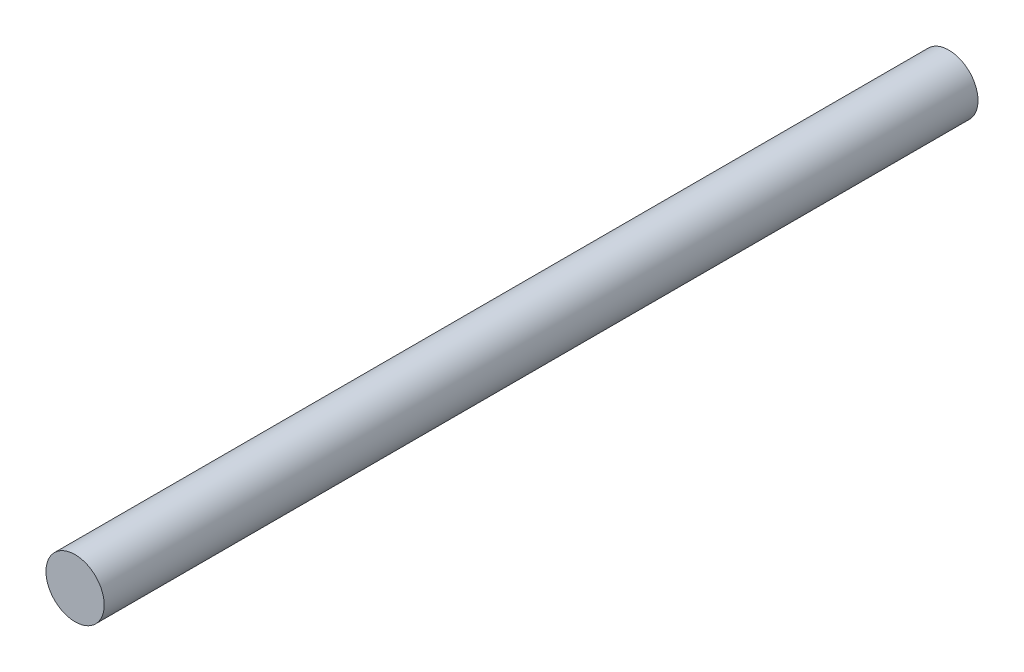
ISO-10303-21;
HEADER;
FILE_DESCRIPTION(('STEP AP214'),'2;1');
FILE_NAME('part.step','',(''),(''),'','','');
FILE_SCHEMA(('AUTOMOTIVE_DESIGN { 1 0 10303 214 1 1 1 1 }'));
ENDSEC;
DATA;
#1=APPLICATION_CONTEXT('core data for automotive mechanical design processes');
#2=APPLICATION_PROTOCOL_DEFINITION('international standard','automotive_design',2000,#1);
#3=PRODUCT_CONTEXT('',#1,'mechanical');
#4=PRODUCT('Part','Part','',(#3));
#5=PRODUCT_RELATED_PRODUCT_CATEGORY('part','',(#4));
#6=PRODUCT_DEFINITION_FORMATION('','',#4);
#7=PRODUCT_DEFINITION_CONTEXT('part definition',#1,'design');
#8=PRODUCT_DEFINITION('design','',#6,#7);
#9=PRODUCT_DEFINITION_SHAPE('','',#8);
#10=(LENGTH_UNIT() NAMED_UNIT(*) SI_UNIT(.MILLI.,.METRE.));
#11=(NAMED_UNIT(*) PLANE_ANGLE_UNIT() SI_UNIT($,.RADIAN.));
#12=(NAMED_UNIT(*) SI_UNIT($,.STERADIAN.) SOLID_ANGLE_UNIT());
#13=UNCERTAINTY_MEASURE_WITH_UNIT(LENGTH_MEASURE(1.E-05),#10,'distance_accuracy_value','');
#14=(GEOMETRIC_REPRESENTATION_CONTEXT(3) GLOBAL_UNCERTAINTY_ASSIGNED_CONTEXT((#13)) GLOBAL_UNIT_ASSIGNED_CONTEXT((#10,
#11,#12)) REPRESENTATION_CONTEXT('',''));
#15=CARTESIAN_POINT('',(0.,0.,0.));
#16=DIRECTION('',(0.,0.,1.));
#17=DIRECTION('',(1.,0.,0.));
#18=AXIS2_PLACEMENT_3D('',#15,#16,#17);
#19=CARTESIAN_POINT('',(0.,0.,-762.));
#20=DIRECTION('',(0.,0.,1.));
#21=DIRECTION('',(1.,0.,0.));
#22=AXIS2_PLACEMENT_3D('',#19,#20,#21);
#23=CYLINDRICAL_SURFACE('',#22,25.4);
#24=CARTESIAN_POINT('',(0.,0.,-762.));
#25=DIRECTION('',(0.,0.,1.));
#26=DIRECTION('',(1.,0.,0.));
#27=AXIS2_PLACEMENT_3D('',#24,#25,#26);
#28=CIRCLE('',#27,25.4);
#29=CARTESIAN_POINT('',(25.4,0.,-762.));
#30=VERTEX_POINT('',#29);
#31=EDGE_CURVE('E10',#30,#30,#28,.T.);
#32=ORIENTED_EDGE('',*,*,#31,.T.);
#33=EDGE_LOOP('',(#32));
#34=FACE_BOUND('',#33,.T.);
#35=CARTESIAN_POINT('',(0.,0.,0.));
#36=DIRECTION('',(0.,0.,1.));
#37=DIRECTION('',(1.,0.,0.));
#38=AXIS2_PLACEMENT_3D('',#35,#36,#37);
#39=CIRCLE('',#38,25.4);
#40=CARTESIAN_POINT('',(25.4,0.,0.));
#41=VERTEX_POINT('',#40);
#42=EDGE_CURVE('E46',#41,#41,#39,.T.);
#43=ORIENTED_EDGE('',*,*,#42,.F.);
#44=EDGE_LOOP('',(#43));
#45=FACE_BOUND('',#44,.T.);
#46=ADVANCED_FACE('F43',(#34,#45),#23,.T.);
#47=CARTESIAN_POINT('',(0.,0.,-762.));
#48=DIRECTION('',(0.,0.,1.));
#49=DIRECTION('',(1.,0.,0.));
#50=AXIS2_PLACEMENT_3D('',#47,#48,#49);
#51=PLANE('',#50);
#52=ORIENTED_EDGE('',*,*,#31,.F.);
#53=EDGE_LOOP('',(#52));
#54=FACE_BOUND('',#53,.T.);
#55=ADVANCED_FACE('F58',(#54),#51,.F.);
#56=CARTESIAN_POINT('',(0.,0.,0.));
#57=DIRECTION('',(0.,0.,1.));
#58=DIRECTION('',(1.,0.,0.));
#59=AXIS2_PLACEMENT_3D('',#56,#57,#58);
#60=PLANE('',#59);
#61=ORIENTED_EDGE('',*,*,#42,.T.);
#62=EDGE_LOOP('',(#61));
#63=FACE_BOUND('',#62,.T.);
#64=ADVANCED_FACE('F60',(#63),#60,.T.);
#65=CLOSED_SHELL('',(#46,#55,#64));
#66=MANIFOLD_SOLID_BREP('B2',#65);
#67=ADVANCED_BREP_SHAPE_REPRESENTATION('',(#18,#66),#14);
#68=SHAPE_DEFINITION_REPRESENTATION(#9,#67);
ENDSEC;
END-ISO-10303-21;
